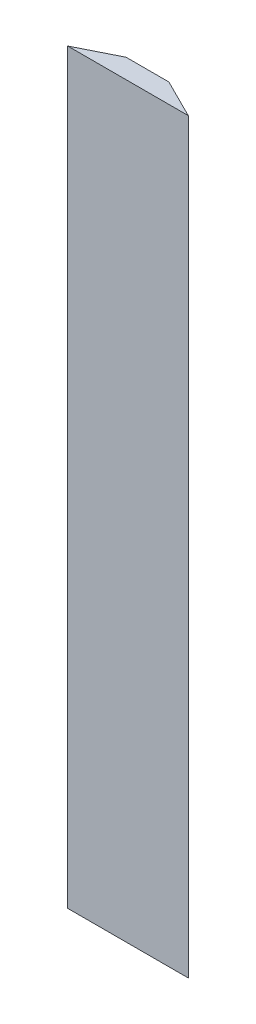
from build123d import *

# Parameters (mm, degrees)
BOSS_EXTRUDE1_DEPTH = 1219.2


with BuildPart() as part:
    # Sketch1 → Boss-Extrude1 (new body)
    with BuildSketch(Plane(origin=(0, 0, 0), x_dir=(1, 0, 0), z_dir=(0, 1, 0))):
        Polygon((-98.425, 0), (-34.925, 31.75), (34.925, 31.75), (98.425, 0), align=None)
    extrude(amount=BOSS_EXTRUDE1_DEPTH)


solid = part.part
